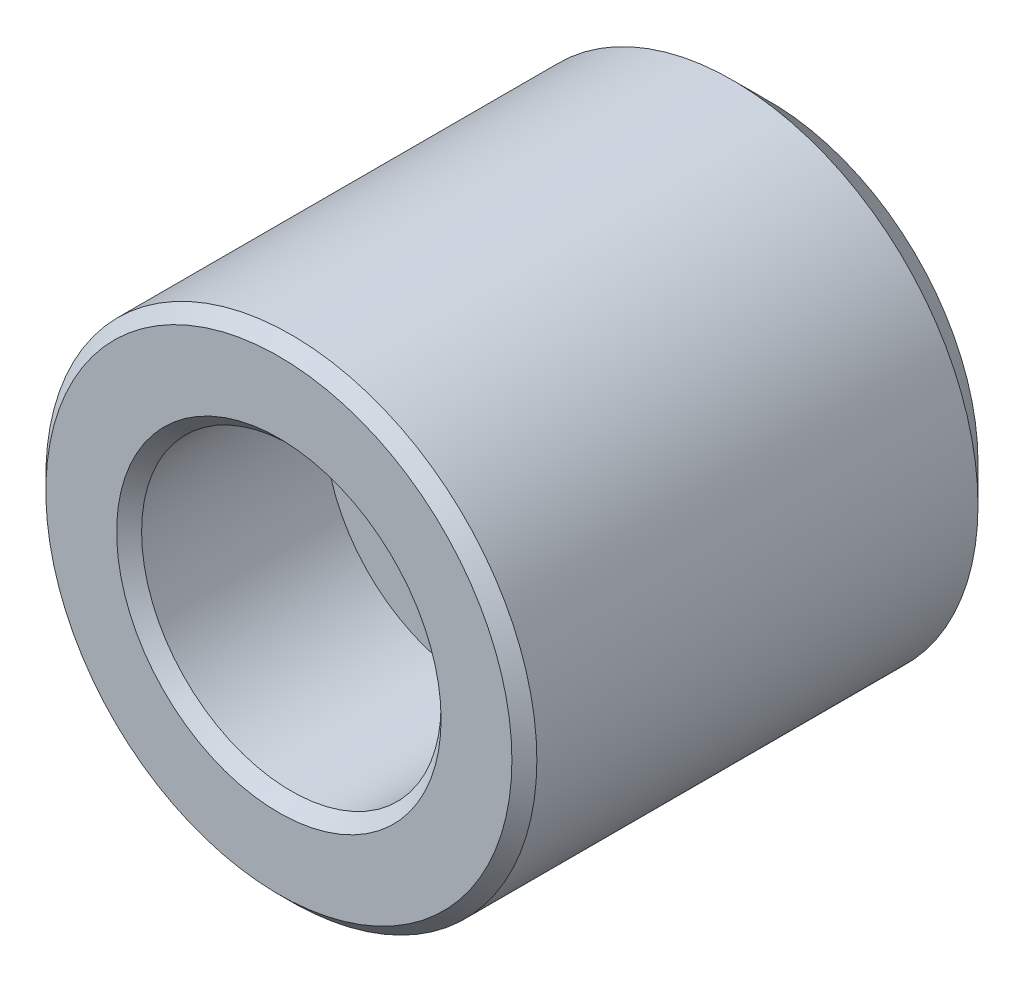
ISO-10303-21;
HEADER;
FILE_DESCRIPTION(('STEP AP214'),'2;1');
FILE_NAME('part.step','',(''),(''),'','','');
FILE_SCHEMA(('AUTOMOTIVE_DESIGN { 1 0 10303 214 1 1 1 1 }'));
ENDSEC;
DATA;
#1=APPLICATION_CONTEXT('core data for automotive mechanical design processes');
#2=APPLICATION_PROTOCOL_DEFINITION('international standard','automotive_design',2000,#1);
#3=PRODUCT_CONTEXT('',#1,'mechanical');
#4=PRODUCT('Part','Part','',(#3));
#5=PRODUCT_RELATED_PRODUCT_CATEGORY('part','',(#4));
#6=PRODUCT_DEFINITION_FORMATION('','',#4);
#7=PRODUCT_DEFINITION_CONTEXT('part definition',#1,'design');
#8=PRODUCT_DEFINITION('design','',#6,#7);
#9=PRODUCT_DEFINITION_SHAPE('','',#8);
#10=(LENGTH_UNIT() NAMED_UNIT(*) SI_UNIT(.MILLI.,.METRE.));
#11=(NAMED_UNIT(*) PLANE_ANGLE_UNIT() SI_UNIT($,.RADIAN.));
#12=(NAMED_UNIT(*) SI_UNIT($,.STERADIAN.) SOLID_ANGLE_UNIT());
#13=UNCERTAINTY_MEASURE_WITH_UNIT(LENGTH_MEASURE(1.E-05),#10,'distance_accuracy_value','');
#14=(GEOMETRIC_REPRESENTATION_CONTEXT(3) GLOBAL_UNCERTAINTY_ASSIGNED_CONTEXT((#13)) GLOBAL_UNIT_ASSIGNED_CONTEXT((#10,
#11,#12)) REPRESENTATION_CONTEXT('',''));
#15=CARTESIAN_POINT('',(0.,0.,0.));
#16=DIRECTION('',(0.,0.,1.));
#17=DIRECTION('',(1.,0.,0.));
#18=AXIS2_PLACEMENT_3D('',#15,#16,#17);
#19=CARTESIAN_POINT('',(0.,0.,10.));
#20=DIRECTION('',(0.,0.,1.));
#21=DIRECTION('',(1.,0.,0.));
#22=AXIS2_PLACEMENT_3D('',#19,#20,#21);
#23=CYLINDRICAL_SURFACE('',#22,1.8668999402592);
#24=CARTESIAN_POINT('',(0.,0.,0.2540000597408));
#25=DIRECTION('',(0.,0.,1.));
#26=DIRECTION('',(1.,0.,0.));
#27=AXIS2_PLACEMENT_3D('',#24,#25,#26);
#28=CIRCLE('',#27,1.8668999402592);
#29=CARTESIAN_POINT('',(1.8668999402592,0.,0.2540000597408));
#30=VERTEX_POINT('',#29);
#31=EDGE_CURVE('E32',#30,#30,#28,.T.);
#32=ORIENTED_EDGE('',*,*,#31,.F.);
#33=EDGE_LOOP('',(#32));
#34=FACE_BOUND('',#33,.T.);
#35=CARTESIAN_POINT('',(0.,0.,6.0122));
#36=DIRECTION('',(0.,0.,1.));
#37=DIRECTION('',(1.,0.,0.));
#38=AXIS2_PLACEMENT_3D('',#35,#36,#37);
#39=CIRCLE('',#38,1.8668999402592);
#40=CARTESIAN_POINT('',(1.8668999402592,0.,6.0122));
#41=VERTEX_POINT('',#40);
#42=EDGE_CURVE('E30',#41,#41,#39,.F.);
#43=ORIENTED_EDGE('',*,*,#42,.F.);
#44=EDGE_LOOP('',(#43));
#45=FACE_BOUND('',#44,.T.);
#46=ADVANCED_FACE('F12',(#34,#45),#23,.F.);
#47=CARTESIAN_POINT('',(0.,0.,0.));
#48=DIRECTION('',(0.,0.,1.));
#49=DIRECTION('',(1.,0.,0.));
#50=AXIS2_PLACEMENT_3D('',#47,#48,#49);
#51=CYLINDRICAL_SURFACE('',#50,5.);
#52=CARTESIAN_POINT('',(0.,0.,0.762));
#53=DIRECTION('',(0.,0.,1.));
#54=DIRECTION('',(1.,0.,0.));
#55=AXIS2_PLACEMENT_3D('',#52,#53,#54);
#56=CIRCLE('',#55,5.);
#57=CARTESIAN_POINT('',(5.,0.,0.762));
#58=VERTEX_POINT('',#57);
#59=EDGE_CURVE('E27',#58,#58,#56,.T.);
#60=ORIENTED_EDGE('',*,*,#59,.T.);
#61=EDGE_LOOP('',(#60));
#62=FACE_BOUND('',#61,.T.);
#63=CARTESIAN_POINT('',(0.,0.,9.746));
#64=DIRECTION('',(0.,0.,1.));
#65=DIRECTION('',(1.,0.,0.));
#66=AXIS2_PLACEMENT_3D('',#63,#64,#65);
#67=CIRCLE('',#66,5.);
#68=CARTESIAN_POINT('',(5.,0.,9.746));
#69=VERTEX_POINT('',#68);
#70=EDGE_CURVE('E37',#69,#69,#67,.F.);
#71=ORIENTED_EDGE('',*,*,#70,.T.);
#72=EDGE_LOOP('',(#71));
#73=FACE_BOUND('',#72,.T.);
#74=ADVANCED_FACE('F67',(#62,#73),#51,.T.);
#75=CARTESIAN_POINT('',(0.,0.,0.));
#76=DIRECTION('',(0.,0.,1.));
#77=DIRECTION('',(1.,0.,0.));
#78=AXIS2_PLACEMENT_3D('',#75,#76,#77);
#79=PLANE('',#78);
#80=CARTESIAN_POINT('',(0.,0.,0.));
#81=DIRECTION('',(0.,0.,1.));
#82=DIRECTION('',(1.,0.,0.));
#83=AXIS2_PLACEMENT_3D('',#80,#81,#82);
#84=CIRCLE('',#83,2.1209);
#85=CARTESIAN_POINT('',(2.1209,0.,0.));
#86=VERTEX_POINT('',#85);
#87=EDGE_CURVE('E43',#86,#86,#84,.T.);
#88=ORIENTED_EDGE('',*,*,#87,.T.);
#89=EDGE_LOOP('',(#88));
#90=FACE_BOUND('',#89,.T.);
#91=CARTESIAN_POINT('',(0.,0.,0.));
#92=DIRECTION('',(0.,0.,1.));
#93=DIRECTION('',(1.,0.,0.));
#94=AXIS2_PLACEMENT_3D('',#91,#92,#93);
#95=CIRCLE('',#94,4.238);
#96=CARTESIAN_POINT('',(4.238,0.,0.));
#97=VERTEX_POINT('',#96);
#98=EDGE_CURVE('E23',#97,#97,#95,.F.);
#99=ORIENTED_EDGE('',*,*,#98,.T.);
#100=EDGE_LOOP('',(#99));
#101=FACE_BOUND('',#100,.T.);
#102=ADVANCED_FACE('F72',(#90,#101),#79,.F.);
#103=CARTESIAN_POINT('',(0.,0.,10.));
#104=DIRECTION('',(0.,0.,1.));
#105=DIRECTION('',(1.,0.,0.));
#106=AXIS2_PLACEMENT_3D('',#103,#104,#105);
#107=PLANE('',#106);
#108=CARTESIAN_POINT('',(0.,0.,10.));
#109=DIRECTION('',(0.,0.,1.));
#110=DIRECTION('',(1.,0.,0.));
#111=AXIS2_PLACEMENT_3D('',#108,#109,#110);
#112=CIRCLE('',#111,3.304);
#113=CARTESIAN_POINT('',(3.304,0.,10.));
#114=VERTEX_POINT('',#113);
#115=EDGE_CURVE('E8',#114,#114,#112,.F.);
#116=ORIENTED_EDGE('',*,*,#115,.T.);
#117=EDGE_LOOP('',(#116));
#118=FACE_BOUND('',#117,.T.);
#119=CARTESIAN_POINT('',(0.,0.,10.));
#120=DIRECTION('',(0.,0.,1.));
#121=DIRECTION('',(1.,0.,0.));
#122=AXIS2_PLACEMENT_3D('',#119,#120,#121);
#123=CIRCLE('',#122,4.746);
#124=CARTESIAN_POINT('',(4.746,0.,10.));
#125=VERTEX_POINT('',#124);
#126=EDGE_CURVE('E40',#125,#125,#123,.T.);
#127=ORIENTED_EDGE('',*,*,#126,.T.);
#128=EDGE_LOOP('',(#127));
#129=FACE_BOUND('',#128,.T.);
#130=ADVANCED_FACE('F84',(#118,#129),#107,.T.);
#131=CARTESIAN_POINT('',(0.,0.,10.));
#132=DIRECTION('',(0.,0.,-1.));
#133=DIRECTION('',(-1.,0.,0.));
#134=AXIS2_PLACEMENT_3D('',#131,#132,#133);
#135=CONICAL_SURFACE('',#134,4.746,0.785398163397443);
#136=ORIENTED_EDGE('',*,*,#70,.F.);
#137=EDGE_LOOP('',(#136));
#138=FACE_BOUND('',#137,.T.);
#139=ORIENTED_EDGE('',*,*,#126,.F.);
#140=EDGE_LOOP('',(#139));
#141=FACE_BOUND('',#140,.T.);
#142=ADVANCED_FACE('F87',(#138,#141),#135,.T.);
#143=CARTESIAN_POINT('',(0.,0.,0.762));
#144=DIRECTION('',(0.,0.,1.));
#145=DIRECTION('',(1.,0.,0.));
#146=AXIS2_PLACEMENT_3D('',#143,#144,#145);
#147=CONICAL_SURFACE('',#146,5.,0.785398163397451);
#148=ORIENTED_EDGE('',*,*,#98,.F.);
#149=EDGE_LOOP('',(#148));
#150=FACE_BOUND('',#149,.T.);
#151=ORIENTED_EDGE('',*,*,#59,.F.);
#152=EDGE_LOOP('',(#151));
#153=FACE_BOUND('',#152,.T.);
#154=ADVANCED_FACE('F80',(#150,#153),#147,.T.);
#155=CARTESIAN_POINT('',(0.,0.,0.2540000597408));
#156=DIRECTION('',(0.,0.,-1.));
#157=DIRECTION('',(-1.,0.,0.));
#158=AXIS2_PLACEMENT_3D('',#155,#156,#157);
#159=CONICAL_SURFACE('',#158,1.8668999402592,0.785398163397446);
#160=ORIENTED_EDGE('',*,*,#87,.F.);
#161=EDGE_LOOP('',(#160));
#162=FACE_BOUND('',#161,.T.);
#163=ORIENTED_EDGE('',*,*,#31,.T.);
#164=EDGE_LOOP('',(#163));
#165=FACE_BOUND('',#164,.T.);
#166=ADVANCED_FACE('F63',(#162,#165),#159,.F.);
#167=CARTESIAN_POINT('',(0.,0.,6.0122));
#168=DIRECTION('',(0.,0.,1.));
#169=DIRECTION('',(1.,0.,0.));
#170=AXIS2_PLACEMENT_3D('',#167,#168,#169);
#171=PLANE('',#170);
#172=CARTESIAN_POINT('',(0.,0.,6.0122));
#173=DIRECTION('',(0.,0.,1.));
#174=DIRECTION('',(1.,0.,0.));
#175=AXIS2_PLACEMENT_3D('',#172,#173,#174);
#176=CIRCLE('',#175,3.05);
#177=CARTESIAN_POINT('',(3.05,0.,6.0122));
#178=VERTEX_POINT('',#177);
#179=EDGE_CURVE('E33',#178,#178,#176,.T.);
#180=ORIENTED_EDGE('',*,*,#179,.T.);
#181=EDGE_LOOP('',(#180));
#182=FACE_BOUND('',#181,.T.);
#183=ORIENTED_EDGE('',*,*,#42,.T.);
#184=EDGE_LOOP('',(#183));
#185=FACE_BOUND('',#184,.T.);
#186=ADVANCED_FACE('F51',(#182,#185),#171,.T.);
#187=CARTESIAN_POINT('',(0.,0.,6.0122));
#188=DIRECTION('',(0.,0.,1.));
#189=DIRECTION('',(1.,0.,0.));
#190=AXIS2_PLACEMENT_3D('',#187,#188,#189);
#191=CYLINDRICAL_SURFACE('',#190,3.05);
#192=CARTESIAN_POINT('',(0.,0.,9.746));
#193=DIRECTION('',(0.,0.,1.));
#194=DIRECTION('',(1.,0.,0.));
#195=AXIS2_PLACEMENT_3D('',#192,#193,#194);
#196=CIRCLE('',#195,3.05);
#197=CARTESIAN_POINT('',(3.05,0.,9.746));
#198=VERTEX_POINT('',#197);
#199=EDGE_CURVE('E19',#198,#198,#196,.T.);
#200=ORIENTED_EDGE('',*,*,#199,.T.);
#201=EDGE_LOOP('',(#200));
#202=FACE_BOUND('',#201,.T.);
#203=ORIENTED_EDGE('',*,*,#179,.F.);
#204=EDGE_LOOP('',(#203));
#205=FACE_BOUND('',#204,.T.);
#206=ADVANCED_FACE('F54',(#202,#205),#191,.F.);
#207=CARTESIAN_POINT('',(0.,0.,9.746));
#208=DIRECTION('',(0.,0.,1.));
#209=DIRECTION('',(1.,0.,0.));
#210=AXIS2_PLACEMENT_3D('',#207,#208,#209);
#211=CONICAL_SURFACE('',#210,3.05,0.785398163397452);
#212=ORIENTED_EDGE('',*,*,#115,.F.);
#213=EDGE_LOOP('',(#212));
#214=FACE_BOUND('',#213,.T.);
#215=ORIENTED_EDGE('',*,*,#199,.F.);
#216=EDGE_LOOP('',(#215));
#217=FACE_BOUND('',#216,.T.);
#218=ADVANCED_FACE('F14',(#214,#217),#211,.F.);
#219=CLOSED_SHELL('',(#46,#74,#102,#130,#142,#154,#166,#186,#206,#218));
#220=MANIFOLD_SOLID_BREP('B1',#219);
#221=ADVANCED_BREP_SHAPE_REPRESENTATION('',(#18,#220),#14);
#222=SHAPE_DEFINITION_REPRESENTATION(#9,#221);
ENDSEC;
END-ISO-10303-21;
